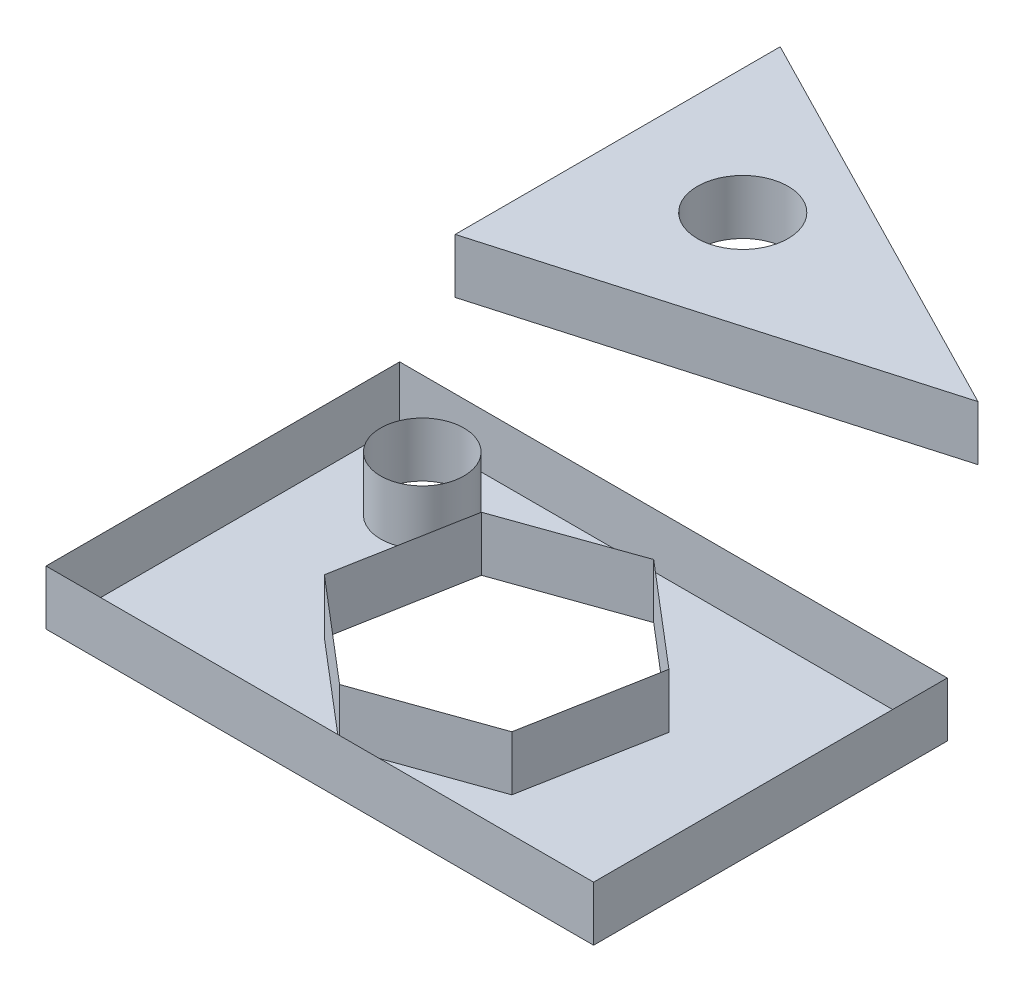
ISO-10303-21;
HEADER;
FILE_DESCRIPTION(('STEP AP214'),'2;1');
FILE_NAME('part.step','',(''),(''),'','','');
FILE_SCHEMA(('AUTOMOTIVE_DESIGN { 1 0 10303 214 1 1 1 1 }'));
ENDSEC;
DATA;
#1=APPLICATION_CONTEXT('core data for automotive mechanical design processes');
#2=APPLICATION_PROTOCOL_DEFINITION('international standard','automotive_design',2000,#1);
#3=PRODUCT_CONTEXT('',#1,'mechanical');
#4=PRODUCT('Part','Part','',(#3));
#5=PRODUCT_RELATED_PRODUCT_CATEGORY('part','',(#4));
#6=PRODUCT_DEFINITION_FORMATION('','',#4);
#7=PRODUCT_DEFINITION_CONTEXT('part definition',#1,'design');
#8=PRODUCT_DEFINITION('design','',#6,#7);
#9=PRODUCT_DEFINITION_SHAPE('','',#8);
#10=(LENGTH_UNIT() NAMED_UNIT(*) SI_UNIT(.MILLI.,.METRE.));
#11=(NAMED_UNIT(*) PLANE_ANGLE_UNIT() SI_UNIT($,.RADIAN.));
#12=(NAMED_UNIT(*) SI_UNIT($,.STERADIAN.) SOLID_ANGLE_UNIT());
#13=UNCERTAINTY_MEASURE_WITH_UNIT(LENGTH_MEASURE(1.E-05),#10,'distance_accuracy_value','');
#14=(GEOMETRIC_REPRESENTATION_CONTEXT(3) GLOBAL_UNCERTAINTY_ASSIGNED_CONTEXT((#13)) GLOBAL_UNIT_ASSIGNED_CONTEXT((#10,
#11,#12)) REPRESENTATION_CONTEXT('',''));
#15=CARTESIAN_POINT('',(0.,0.,0.));
#16=DIRECTION('',(0.,0.,1.));
#17=DIRECTION('',(1.,0.,0.));
#18=AXIS2_PLACEMENT_3D('',#15,#16,#17);
#19=CARTESIAN_POINT('',(38.4002075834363,-25.4,64.2241258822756));
#20=DIRECTION('',(-1.,0.,0.));
#21=DIRECTION('',(0.,0.,1.));
#22=AXIS2_PLACEMENT_3D('',#19,#20,#21);
#23=PLANE('',#22);
#24=DIRECTION('',(0.,0.,1.));
#25=VECTOR('',#24,1.);
#26=CARTESIAN_POINT('',(38.4002075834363,0.,64.2241258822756));
#27=LINE('',#26,#25);
#28=CARTESIAN_POINT('',(38.4002075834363,0.,64.2241258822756));
#29=VERTEX_POINT('',#28);
#30=CARTESIAN_POINT('',(38.4002075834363,0.,228.641244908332));
#31=VERTEX_POINT('',#30);
#32=EDGE_CURVE('E179',#29,#31,#27,.T.);
#33=ORIENTED_EDGE('',*,*,#32,.F.);
#34=DIRECTION('',(0.,1.,0.));
#35=VECTOR('',#34,1.);
#36=CARTESIAN_POINT('',(38.4002075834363,-25.4,64.2241258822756));
#37=LINE('',#36,#35);
#38=CARTESIAN_POINT('',(38.4002075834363,-25.4,64.2241258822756));
#39=VERTEX_POINT('',#38);
#40=EDGE_CURVE('E12',#39,#29,#37,.T.);
#41=ORIENTED_EDGE('',*,*,#40,.F.);
#42=DIRECTION('',(0.,0.,1.));
#43=VECTOR('',#42,1.);
#44=CARTESIAN_POINT('',(38.4002075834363,-25.4,64.2241258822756));
#45=LINE('',#44,#43);
#46=CARTESIAN_POINT('',(38.4002075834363,-25.4,228.641244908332));
#47=VERTEX_POINT('',#46);
#48=EDGE_CURVE('E190',#39,#47,#45,.T.);
#49=ORIENTED_EDGE('',*,*,#48,.T.);
#50=DIRECTION('',(0.,1.,0.));
#51=VECTOR('',#50,1.);
#52=CARTESIAN_POINT('',(38.4002075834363,-25.4,228.641244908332));
#53=LINE('',#52,#51);
#54=EDGE_CURVE('E53',#47,#31,#53,.T.);
#55=ORIENTED_EDGE('',*,*,#54,.T.);
#56=EDGE_LOOP('',(#33,#41,#49,#55));
#57=FACE_BOUND('',#56,.T.);
#58=ADVANCED_FACE('F51',(#57),#23,.T.);
#59=CARTESIAN_POINT('',(38.4002075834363,-25.4,64.2241258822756));
#60=DIRECTION('',(0.,0.,-1.));
#61=DIRECTION('',(-1.,0.,0.));
#62=AXIS2_PLACEMENT_3D('',#59,#60,#61);
#63=PLANE('',#62);
#64=DIRECTION('',(-1.,0.,0.));
#65=VECTOR('',#64,1.);
#66=CARTESIAN_POINT('',(38.4002075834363,0.,64.2241258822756));
#67=LINE('',#66,#65);
#68=CARTESIAN_POINT('',(292.981553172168,0.,64.2241258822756));
#69=VERTEX_POINT('',#68);
#70=EDGE_CURVE('E194',#69,#29,#67,.T.);
#71=ORIENTED_EDGE('',*,*,#70,.F.);
#72=DIRECTION('',(0.,1.,0.));
#73=VECTOR('',#72,1.);
#74=CARTESIAN_POINT('',(292.981553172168,-25.4,64.2241258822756));
#75=LINE('',#74,#73);
#76=CARTESIAN_POINT('',(292.981553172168,-25.4,64.2241258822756));
#77=VERTEX_POINT('',#76);
#78=EDGE_CURVE('E57',#77,#69,#75,.T.);
#79=ORIENTED_EDGE('',*,*,#78,.F.);
#80=DIRECTION('',(-1.,0.,0.));
#81=VECTOR('',#80,1.);
#82=CARTESIAN_POINT('',(38.4002075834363,-25.4,64.2241258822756));
#83=LINE('',#82,#81);
#84=EDGE_CURVE('E200',#77,#39,#83,.T.);
#85=ORIENTED_EDGE('',*,*,#84,.T.);
#86=ORIENTED_EDGE('',*,*,#40,.T.);
#87=EDGE_LOOP('',(#71,#79,#85,#86));
#88=FACE_BOUND('',#87,.T.);
#89=ADVANCED_FACE('F231',(#88),#63,.T.);
#90=CARTESIAN_POINT('',(292.981553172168,-25.4,64.2241258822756));
#91=DIRECTION('',(1.,0.,0.));
#92=DIRECTION('',(0.,0.,-1.));
#93=AXIS2_PLACEMENT_3D('',#90,#91,#92);
#94=PLANE('',#93);
#95=DIRECTION('',(0.,0.,-1.));
#96=VECTOR('',#95,1.);
#97=CARTESIAN_POINT('',(292.981553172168,0.,64.2241258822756));
#98=LINE('',#97,#96);
#99=CARTESIAN_POINT('',(292.981553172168,0.,228.641244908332));
#100=VERTEX_POINT('',#99);
#101=EDGE_CURVE('E210',#100,#69,#98,.T.);
#102=ORIENTED_EDGE('',*,*,#101,.F.);
#103=DIRECTION('',(0.,1.,0.));
#104=VECTOR('',#103,1.);
#105=CARTESIAN_POINT('',(292.981553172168,-25.4,228.641244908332));
#106=LINE('',#105,#104);
#107=CARTESIAN_POINT('',(292.981553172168,-25.4,228.641244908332));
#108=VERTEX_POINT('',#107);
#109=EDGE_CURVE('E217',#108,#100,#106,.T.);
#110=ORIENTED_EDGE('',*,*,#109,.F.);
#111=DIRECTION('',(0.,0.,-1.));
#112=VECTOR('',#111,1.);
#113=CARTESIAN_POINT('',(292.981553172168,-25.4,64.2241258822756));
#114=LINE('',#113,#112);
#115=EDGE_CURVE('E197',#108,#77,#114,.T.);
#116=ORIENTED_EDGE('',*,*,#115,.T.);
#117=ORIENTED_EDGE('',*,*,#78,.T.);
#118=EDGE_LOOP('',(#102,#110,#116,#117));
#119=FACE_BOUND('',#118,.T.);
#120=ADVANCED_FACE('F229',(#119),#94,.T.);
#121=CARTESIAN_POINT('',(38.4002075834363,-25.4,228.641244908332));
#122=DIRECTION('',(0.,0.,1.));
#123=DIRECTION('',(1.,0.,0.));
#124=AXIS2_PLACEMENT_3D('',#121,#122,#123);
#125=PLANE('',#124);
#126=DIRECTION('',(1.,0.,0.));
#127=VECTOR('',#126,1.);
#128=CARTESIAN_POINT('',(38.4002075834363,0.,228.641244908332));
#129=LINE('',#128,#127);
#130=EDGE_CURVE('E206',#31,#100,#129,.T.);
#131=ORIENTED_EDGE('',*,*,#130,.F.);
#132=ORIENTED_EDGE('',*,*,#54,.F.);
#133=DIRECTION('',(1.,0.,0.));
#134=VECTOR('',#133,1.);
#135=CARTESIAN_POINT('',(38.4002075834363,-25.4,228.641244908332));
#136=LINE('',#135,#134);
#137=EDGE_CURVE('E193',#47,#108,#136,.T.);
#138=ORIENTED_EDGE('',*,*,#137,.T.);
#139=ORIENTED_EDGE('',*,*,#109,.T.);
#140=EDGE_LOOP('',(#131,#132,#138,#139));
#141=FACE_BOUND('',#140,.T.);
#142=ADVANCED_FACE('F225',(#141),#125,.T.);
#143=CARTESIAN_POINT('',(0.,-25.4,0.));
#144=DIRECTION('',(0.,1.,0.));
#145=DIRECTION('',(0.,0.,1.));
#146=AXIS2_PLACEMENT_3D('',#143,#144,#145);
#147=PLANE('',#146);
#148=CARTESIAN_POINT('',(79.9464688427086,-25.4,95.2665323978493));
#149=DIRECTION('',(0.,1.,0.));
#150=DIRECTION('',(0.,0.,1.));
#151=AXIS2_PLACEMENT_3D('',#148,#149,#150);
#152=CIRCLE('',#151,19.3434847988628);
#153=CARTESIAN_POINT('',(79.9464688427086,-25.4,114.610017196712));
#154=VERTEX_POINT('',#153);
#155=EDGE_CURVE('E166',#154,#154,#152,.T.);
#156=ORIENTED_EDGE('',*,*,#155,.T.);
#157=EDGE_LOOP('',(#156));
#158=FACE_BOUND('',#157,.T.);
#159=DIRECTION('',(0.761243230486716,0.,0.648466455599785));
#160=VECTOR('',#159,1.);
#161=CARTESIAN_POINT('',(106.609295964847,-25.4,167.440394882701));
#162=LINE('',#161,#160);
#163=CARTESIAN_POINT('',(106.609295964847,-25.4,167.440394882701));
#164=VERTEX_POINT('',#163);
#165=CARTESIAN_POINT('',(154.343298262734,-25.4,208.102693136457));
#166=VERTEX_POINT('',#165);
#167=EDGE_CURVE('E137',#164,#166,#162,.T.);
#168=ORIENTED_EDGE('',*,*,#167,.T.);
#169=DIRECTION('',(0.942210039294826,0.,-0.335022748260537));
#170=VECTOR('',#169,1.);
#171=CARTESIAN_POINT('',(154.343298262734,-25.4,208.102693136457));
#172=LINE('',#171,#170);
#173=CARTESIAN_POINT('',(213.42488267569,-25.4,187.094983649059));
#174=VERTEX_POINT('',#173);
#175=EDGE_CURVE('E131',#166,#174,#172,.T.);
#176=ORIENTED_EDGE('',*,*,#175,.T.);
#177=DIRECTION('',(0.180966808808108,0.,-0.983489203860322));
#178=VECTOR('',#177,1.);
#179=CARTESIAN_POINT('',(213.42488267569,-25.4,187.094983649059));
#180=LINE('',#179,#178);
#181=CARTESIAN_POINT('',(224.772464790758,-25.4,125.424975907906));
#182=VERTEX_POINT('',#181);
#183=EDGE_CURVE('E140',#174,#182,#180,.T.);
#184=ORIENTED_EDGE('',*,*,#183,.T.);
#185=DIRECTION('',(-0.761243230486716,0.,-0.648466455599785));
#186=VECTOR('',#185,1.);
#187=CARTESIAN_POINT('',(224.772464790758,-25.4,125.424975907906));
#188=LINE('',#187,#186);
#189=CARTESIAN_POINT('',(177.03846249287,-25.4,84.7626776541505));
#190=VERTEX_POINT('',#189);
#191=EDGE_CURVE('E65',#182,#190,#188,.T.);
#192=ORIENTED_EDGE('',*,*,#191,.T.);
#193=DIRECTION('',(-0.942210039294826,0.,0.335022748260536));
#194=VECTOR('',#193,1.);
#195=CARTESIAN_POINT('',(177.03846249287,-25.4,84.7626776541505));
#196=LINE('',#195,#194);
#197=CARTESIAN_POINT('',(117.956878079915,-25.4,105.770387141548));
#198=VERTEX_POINT('',#197);
#199=EDGE_CURVE('E158',#190,#198,#196,.T.);
#200=ORIENTED_EDGE('',*,*,#199,.T.);
#201=DIRECTION('',(-0.180966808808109,0.,0.983489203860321));
#202=VECTOR('',#201,1.);
#203=CARTESIAN_POINT('',(117.956878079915,-25.4,105.770387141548));
#204=LINE('',#203,#202);
#205=EDGE_CURVE('E161',#198,#164,#204,.T.);
#206=ORIENTED_EDGE('',*,*,#205,.T.);
#207=EDGE_LOOP('',(#168,#176,#184,#192,#200,#206));
#208=FACE_BOUND('',#207,.T.);
#209=ORIENTED_EDGE('',*,*,#48,.F.);
#210=ORIENTED_EDGE('',*,*,#84,.F.);
#211=ORIENTED_EDGE('',*,*,#115,.F.);
#212=ORIENTED_EDGE('',*,*,#137,.F.);
#213=EDGE_LOOP('',(#209,#210,#211,#212));
#214=FACE_BOUND('',#213,.T.);
#215=ADVANCED_FACE('F144',(#158,#208,#214),#147,.F.);
#216=CARTESIAN_POINT('',(154.343298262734,-25.4,208.102693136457));
#217=DIRECTION('',(0.335022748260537,0.,0.942210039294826));
#218=DIRECTION('',(0.942210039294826,0.,-0.335022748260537));
#219=AXIS2_PLACEMENT_3D('',#216,#217,#218);
#220=PLANE('',#219);
#221=DIRECTION('',(0.942210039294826,0.,-0.335022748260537));
#222=VECTOR('',#221,1.);
#223=CARTESIAN_POINT('',(154.343298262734,0.,208.102693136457));
#224=LINE('',#223,#222);
#225=CARTESIAN_POINT('',(154.343298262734,0.,208.102693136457));
#226=VERTEX_POINT('',#225);
#227=CARTESIAN_POINT('',(213.42488267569,0.,187.094983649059));
#228=VERTEX_POINT('',#227);
#229=EDGE_CURVE('E134',#226,#228,#224,.T.);
#230=ORIENTED_EDGE('',*,*,#229,.T.);
#231=DIRECTION('',(0.,1.,0.));
#232=VECTOR('',#231,1.);
#233=CARTESIAN_POINT('',(213.42488267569,-25.4,187.094983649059));
#234=LINE('',#233,#232);
#235=EDGE_CURVE('E126',#174,#228,#234,.T.);
#236=ORIENTED_EDGE('',*,*,#235,.F.);
#237=ORIENTED_EDGE('',*,*,#175,.F.);
#238=DIRECTION('',(0.,1.,0.));
#239=VECTOR('',#238,1.);
#240=CARTESIAN_POINT('',(154.343298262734,-25.4,208.102693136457));
#241=LINE('',#240,#239);
#242=EDGE_CURVE('E177',#166,#226,#241,.T.);
#243=ORIENTED_EDGE('',*,*,#242,.T.);
#244=EDGE_LOOP('',(#230,#236,#237,#243));
#245=FACE_BOUND('',#244,.T.);
#246=ADVANCED_FACE('F128',(#245),#220,.F.);
#247=CARTESIAN_POINT('',(106.609295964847,-25.4,167.440394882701));
#248=DIRECTION('',(-0.648466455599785,0.,0.761243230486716));
#249=DIRECTION('',(0.761243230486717,0.,0.648466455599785));
#250=AXIS2_PLACEMENT_3D('',#247,#248,#249);
#251=PLANE('',#250);
#252=DIRECTION('',(0.761243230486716,0.,0.648466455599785));
#253=VECTOR('',#252,1.);
#254=CARTESIAN_POINT('',(106.609295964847,0.,167.440394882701));
#255=LINE('',#254,#253);
#256=CARTESIAN_POINT('',(106.609295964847,0.,167.440394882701));
#257=VERTEX_POINT('',#256);
#258=EDGE_CURVE('E148',#257,#226,#255,.T.);
#259=ORIENTED_EDGE('',*,*,#258,.T.);
#260=ORIENTED_EDGE('',*,*,#242,.F.);
#261=ORIENTED_EDGE('',*,*,#167,.F.);
#262=DIRECTION('',(0.,1.,0.));
#263=VECTOR('',#262,1.);
#264=CARTESIAN_POINT('',(106.609295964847,-25.4,167.440394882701));
#265=LINE('',#264,#263);
#266=EDGE_CURVE('E180',#164,#257,#265,.T.);
#267=ORIENTED_EDGE('',*,*,#266,.T.);
#268=EDGE_LOOP('',(#259,#260,#261,#267));
#269=FACE_BOUND('',#268,.T.);
#270=ADVANCED_FACE('F249',(#269),#251,.F.);
#271=CARTESIAN_POINT('',(117.956878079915,-25.4,105.770387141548));
#272=DIRECTION('',(-0.983489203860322,0.,-0.180966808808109));
#273=DIRECTION('',(-0.180966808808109,0.,0.983489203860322));
#274=AXIS2_PLACEMENT_3D('',#271,#272,#273);
#275=PLANE('',#274);
#276=DIRECTION('',(-0.180966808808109,0.,0.983489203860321));
#277=VECTOR('',#276,1.);
#278=CARTESIAN_POINT('',(117.956878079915,0.,105.770387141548));
#279=LINE('',#278,#277);
#280=CARTESIAN_POINT('',(117.956878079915,0.,105.770387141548));
#281=VERTEX_POINT('',#280);
#282=EDGE_CURVE('E151',#281,#257,#279,.T.);
#283=ORIENTED_EDGE('',*,*,#282,.T.);
#284=ORIENTED_EDGE('',*,*,#266,.F.);
#285=ORIENTED_EDGE('',*,*,#205,.F.);
#286=DIRECTION('',(0.,1.,0.));
#287=VECTOR('',#286,1.);
#288=CARTESIAN_POINT('',(117.956878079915,-25.4,105.770387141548));
#289=LINE('',#288,#287);
#290=EDGE_CURVE('E183',#198,#281,#289,.T.);
#291=ORIENTED_EDGE('',*,*,#290,.T.);
#292=EDGE_LOOP('',(#283,#284,#285,#291));
#293=FACE_BOUND('',#292,.T.);
#294=ADVANCED_FACE('F270',(#293),#275,.F.);
#295=CARTESIAN_POINT('',(177.03846249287,-25.4,84.7626776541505));
#296=DIRECTION('',(-0.335022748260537,0.,-0.942210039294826));
#297=DIRECTION('',(-0.942210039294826,0.,0.335022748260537));
#298=AXIS2_PLACEMENT_3D('',#295,#296,#297);
#299=PLANE('',#298);
#300=DIRECTION('',(-0.942210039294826,0.,0.335022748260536));
#301=VECTOR('',#300,1.);
#302=CARTESIAN_POINT('',(177.03846249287,0.,84.7626776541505));
#303=LINE('',#302,#301);
#304=CARTESIAN_POINT('',(177.03846249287,0.,84.7626776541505));
#305=VERTEX_POINT('',#304);
#306=EDGE_CURVE('E172',#305,#281,#303,.T.);
#307=ORIENTED_EDGE('',*,*,#306,.T.);
#308=ORIENTED_EDGE('',*,*,#290,.F.);
#309=ORIENTED_EDGE('',*,*,#199,.F.);
#310=DIRECTION('',(0.,1.,0.));
#311=VECTOR('',#310,1.);
#312=CARTESIAN_POINT('',(177.03846249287,-25.4,84.7626776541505));
#313=LINE('',#312,#311);
#314=EDGE_CURVE('E186',#190,#305,#313,.T.);
#315=ORIENTED_EDGE('',*,*,#314,.T.);
#316=EDGE_LOOP('',(#307,#308,#309,#315));
#317=FACE_BOUND('',#316,.T.);
#318=ADVANCED_FACE('F274',(#317),#299,.F.);
#319=CARTESIAN_POINT('',(224.772464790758,-25.4,125.424975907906));
#320=DIRECTION('',(0.648466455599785,0.,-0.761243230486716));
#321=DIRECTION('',(-0.761243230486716,0.,-0.648466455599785));
#322=AXIS2_PLACEMENT_3D('',#319,#320,#321);
#323=PLANE('',#322);
#324=DIRECTION('',(-0.761243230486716,0.,-0.648466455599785));
#325=VECTOR('',#324,1.);
#326=CARTESIAN_POINT('',(224.772464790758,0.,125.424975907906));
#327=LINE('',#326,#325);
#328=CARTESIAN_POINT('',(224.772464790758,0.,125.424975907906));
#329=VERTEX_POINT('',#328);
#330=EDGE_CURVE('E169',#329,#305,#327,.T.);
#331=ORIENTED_EDGE('',*,*,#330,.T.);
#332=ORIENTED_EDGE('',*,*,#314,.F.);
#333=ORIENTED_EDGE('',*,*,#191,.F.);
#334=DIRECTION('',(0.,1.,0.));
#335=VECTOR('',#334,1.);
#336=CARTESIAN_POINT('',(224.772464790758,-25.4,125.424975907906));
#337=LINE('',#336,#335);
#338=EDGE_CURVE('E136',#182,#329,#337,.T.);
#339=ORIENTED_EDGE('',*,*,#338,.T.);
#340=EDGE_LOOP('',(#331,#332,#333,#339));
#341=FACE_BOUND('',#340,.T.);
#342=ADVANCED_FACE('F265',(#341),#323,.F.);
#343=CARTESIAN_POINT('',(213.42488267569,-25.4,187.094983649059));
#344=DIRECTION('',(0.983489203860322,0.,0.180966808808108));
#345=DIRECTION('',(0.180966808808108,0.,-0.983489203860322));
#346=AXIS2_PLACEMENT_3D('',#343,#344,#345);
#347=PLANE('',#346);
#348=DIRECTION('',(0.180966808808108,0.,-0.983489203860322));
#349=VECTOR('',#348,1.);
#350=CARTESIAN_POINT('',(213.42488267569,0.,187.094983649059));
#351=LINE('',#350,#349);
#352=EDGE_CURVE('E70',#228,#329,#351,.T.);
#353=ORIENTED_EDGE('',*,*,#352,.T.);
#354=ORIENTED_EDGE('',*,*,#338,.F.);
#355=ORIENTED_EDGE('',*,*,#183,.F.);
#356=ORIENTED_EDGE('',*,*,#235,.T.);
#357=EDGE_LOOP('',(#353,#354,#355,#356));
#358=FACE_BOUND('',#357,.T.);
#359=ADVANCED_FACE('F141',(#358),#347,.F.);
#360=CARTESIAN_POINT('',(79.9464688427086,-25.4,95.2665323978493));
#361=DIRECTION('',(0.,1.,0.));
#362=DIRECTION('',(0.,0.,1.));
#363=AXIS2_PLACEMENT_3D('',#360,#361,#362);
#364=CYLINDRICAL_SURFACE('',#363,19.3434847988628);
#365=ORIENTED_EDGE('',*,*,#155,.F.);
#366=EDGE_LOOP('',(#365));
#367=FACE_BOUND('',#366,.T.);
#368=CARTESIAN_POINT('',(79.9464688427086,0.,95.2665323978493));
#369=DIRECTION('',(0.,1.,0.));
#370=DIRECTION('',(0.,0.,1.));
#371=AXIS2_PLACEMENT_3D('',#368,#369,#370);
#372=CIRCLE('',#371,19.3434847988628);
#373=CARTESIAN_POINT('',(79.9464688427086,0.,114.610017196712));
#374=VERTEX_POINT('',#373);
#375=EDGE_CURVE('E154',#374,#374,#372,.T.);
#376=ORIENTED_EDGE('',*,*,#375,.T.);
#377=EDGE_LOOP('',(#376));
#378=FACE_BOUND('',#377,.T.);
#379=ADVANCED_FACE('F259',(#367,#378),#364,.F.);
#380=OPEN_SHELL('',(#58,#89,#120,#142,#215,#246,#270,#294,#318,#342,#359,#379));
#381=SHELL_BASED_SURFACE_MODEL('B2',(#380));
#382=CARTESIAN_POINT('',(188.850758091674,-25.4,-54.2005244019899));
#383=DIRECTION('',(0.275865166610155,0.,0.961196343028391));
#384=DIRECTION('',(0.961196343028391,0.,-0.275865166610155));
#385=AXIS2_PLACEMENT_3D('',#382,#383,#384);
#386=PLANE('',#385);
#387=DIRECTION('',(0.961196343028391,0.,-0.275865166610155));
#388=VECTOR('',#387,1.);
#389=CARTESIAN_POINT('',(188.850758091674,0.,-54.2005244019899));
#390=LINE('',#389,#388);
#391=CARTESIAN_POINT('',(0.,0.,0.));
#392=VERTEX_POINT('',#391);
#393=CARTESIAN_POINT('',(188.850758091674,0.,-54.2005244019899));
#394=VERTEX_POINT('',#393);
#395=EDGE_CURVE('E440',#392,#394,#390,.T.);
#396=ORIENTED_EDGE('',*,*,#395,.F.);
#397=DIRECTION('',(0.,1.,0.));
#398=VECTOR('',#397,1.);
#399=CARTESIAN_POINT('',(0.,-25.4,0.));
#400=LINE('',#399,#398);
#401=CARTESIAN_POINT('',(0.,-25.4,0.));
#402=VERTEX_POINT('',#401);
#403=EDGE_CURVE('E49',#402,#392,#400,.T.);
#404=ORIENTED_EDGE('',*,*,#403,.F.);
#405=DIRECTION('',(0.961196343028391,0.,-0.275865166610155));
#406=VECTOR('',#405,1.);
#407=CARTESIAN_POINT('',(188.850758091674,-25.4,-54.2005244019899));
#408=LINE('',#407,#406);
#409=CARTESIAN_POINT('',(188.850758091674,-25.4,-54.2005244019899));
#410=VERTEX_POINT('',#409);
#411=EDGE_CURVE('E429',#402,#410,#408,.T.);
#412=ORIENTED_EDGE('',*,*,#411,.T.);
#413=DIRECTION('',(0.,1.,0.));
#414=VECTOR('',#413,1.);
#415=CARTESIAN_POINT('',(188.850758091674,-25.4,-54.2005244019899));
#416=LINE('',#415,#414);
#417=EDGE_CURVE('E388',#410,#394,#416,.T.);
#418=ORIENTED_EDGE('',*,*,#417,.T.);
#419=EDGE_LOOP('',(#396,#404,#412,#418));
#420=FACE_BOUND('',#419,.T.);
#421=ADVANCED_FACE('F385',(#420),#386,.T.);
#422=CARTESIAN_POINT('',(0.,-25.4,0.));
#423=DIRECTION('',(-1.,0.,0.));
#424=DIRECTION('',(0.,0.,1.));
#425=AXIS2_PLACEMENT_3D('',#422,#423,#424);
#426=PLANE('',#425);
#427=DIRECTION('',(0.,0.,1.));
#428=VECTOR('',#427,1.);
#429=CARTESIAN_POINT('',(0.,0.,0.));
#430=LINE('',#429,#428);
#431=CARTESIAN_POINT('',(0.,0.,-151.08879673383));
#432=VERTEX_POINT('',#431);
#433=EDGE_CURVE('E431',#432,#392,#430,.T.);
#434=ORIENTED_EDGE('',*,*,#433,.F.);
#435=DIRECTION('',(0.,1.,0.));
#436=VECTOR('',#435,1.);
#437=CARTESIAN_POINT('',(0.,-25.4,-151.08879673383));
#438=LINE('',#437,#436);
#439=CARTESIAN_POINT('',(0.,-25.4,-151.08879673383));
#440=VERTEX_POINT('',#439);
#441=EDGE_CURVE('E394',#440,#432,#438,.T.);
#442=ORIENTED_EDGE('',*,*,#441,.F.);
#443=DIRECTION('',(0.,0.,1.));
#444=VECTOR('',#443,1.);
#445=CARTESIAN_POINT('',(0.,-25.4,0.));
#446=LINE('',#445,#444);
#447=EDGE_CURVE('E426',#440,#402,#446,.T.);
#448=ORIENTED_EDGE('',*,*,#447,.T.);
#449=ORIENTED_EDGE('',*,*,#403,.T.);
#450=EDGE_LOOP('',(#434,#442,#448,#449));
#451=FACE_BOUND('',#450,.T.);
#452=ADVANCED_FACE('F445',(#451),#426,.T.);
#453=CARTESIAN_POINT('',(0.,-25.4,-151.08879673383));
#454=DIRECTION('',(0.456472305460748,0.,-0.889737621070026));
#455=DIRECTION('',(-0.889737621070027,0.,-0.456472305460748));
#456=AXIS2_PLACEMENT_3D('',#453,#454,#455);
#457=PLANE('',#456);
#458=DIRECTION('',(-0.889737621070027,0.,-0.456472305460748));
#459=VECTOR('',#458,1.);
#460=CARTESIAN_POINT('',(0.,0.,-151.08879673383));
#461=LINE('',#460,#459);
#462=EDGE_CURVE('E424',#394,#432,#461,.T.);
#463=ORIENTED_EDGE('',*,*,#462,.F.);
#464=ORIENTED_EDGE('',*,*,#417,.F.);
#465=DIRECTION('',(-0.889737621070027,0.,-0.456472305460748));
#466=VECTOR('',#465,1.);
#467=CARTESIAN_POINT('',(0.,-25.4,-151.08879673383));
#468=LINE('',#467,#466);
#469=EDGE_CURVE('E422',#410,#440,#468,.T.);
#470=ORIENTED_EDGE('',*,*,#469,.T.);
#471=ORIENTED_EDGE('',*,*,#441,.T.);
#472=EDGE_LOOP('',(#463,#464,#470,#471));
#473=FACE_BOUND('',#472,.T.);
#474=ADVANCED_FACE('F421',(#473),#457,.T.);
#475=CARTESIAN_POINT('',(0.,-25.4,0.));
#476=DIRECTION('',(0.,-1.,0.));
#477=DIRECTION('',(0.,0.,-1.));
#478=AXIS2_PLACEMENT_3D('',#475,#476,#477);
#479=PLANE('',#478);
#480=CARTESIAN_POINT('',(58.0016480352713,-25.4,-75.6757600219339));
#481=DIRECTION('',(0.,1.,0.));
#482=DIRECTION('',(0.,0.,1.));
#483=AXIS2_PLACEMENT_3D('',#480,#481,#482);
#484=CIRCLE('',#483,21.0766431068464);
#485=CARTESIAN_POINT('',(58.0016480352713,-25.4,-54.5991169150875));
#486=VERTEX_POINT('',#485);
#487=EDGE_CURVE('E442',#486,#486,#484,.T.);
#488=ORIENTED_EDGE('',*,*,#487,.T.);
#489=EDGE_LOOP('',(#488));
#490=FACE_BOUND('',#489,.T.);
#491=ORIENTED_EDGE('',*,*,#411,.F.);
#492=ORIENTED_EDGE('',*,*,#447,.F.);
#493=ORIENTED_EDGE('',*,*,#469,.F.);
#494=EDGE_LOOP('',(#491,#492,#493));
#495=FACE_BOUND('',#494,.T.);
#496=ADVANCED_FACE('F428',(#490,#495),#479,.T.);
#497=CARTESIAN_POINT('',(0.,0.,0.));
#498=DIRECTION('',(0.,-1.,0.));
#499=DIRECTION('',(0.,0.,-1.));
#500=AXIS2_PLACEMENT_3D('',#497,#498,#499);
#501=PLANE('',#500);
#502=CARTESIAN_POINT('',(58.0016480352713,0.,-75.6757600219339));
#503=DIRECTION('',(0.,1.,0.));
#504=DIRECTION('',(0.,0.,1.));
#505=AXIS2_PLACEMENT_3D('',#502,#503,#504);
#506=CIRCLE('',#505,21.0766431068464);
#507=CARTESIAN_POINT('',(58.0016480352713,0.,-54.5991169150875));
#508=VERTEX_POINT('',#507);
#509=EDGE_CURVE('E436',#508,#508,#506,.T.);
#510=ORIENTED_EDGE('',*,*,#509,.F.);
#511=EDGE_LOOP('',(#510));
#512=FACE_BOUND('',#511,.T.);
#513=ORIENTED_EDGE('',*,*,#395,.T.);
#514=ORIENTED_EDGE('',*,*,#462,.T.);
#515=ORIENTED_EDGE('',*,*,#433,.T.);
#516=EDGE_LOOP('',(#513,#514,#515));
#517=FACE_BOUND('',#516,.T.);
#518=ADVANCED_FACE('F444',(#512,#517),#501,.F.);
#519=CARTESIAN_POINT('',(58.0016480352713,-25.4,-75.6757600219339));
#520=DIRECTION('',(0.,1.,0.));
#521=DIRECTION('',(0.,0.,1.));
#522=AXIS2_PLACEMENT_3D('',#519,#520,#521);
#523=CYLINDRICAL_SURFACE('',#522,21.0766431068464);
#524=ORIENTED_EDGE('',*,*,#487,.F.);
#525=EDGE_LOOP('',(#524));
#526=FACE_BOUND('',#525,.T.);
#527=ORIENTED_EDGE('',*,*,#509,.T.);
#528=EDGE_LOOP('',(#527));
#529=FACE_BOUND('',#528,.T.);
#530=ADVANCED_FACE('F455',(#526,#529),#523,.F.);
#531=CLOSED_SHELL('',(#421,#452,#474,#496,#518,#530));
#532=MANIFOLD_SOLID_BREP('B6',#531);
#533=ADVANCED_BREP_SHAPE_REPRESENTATION('',(#18,#532),#14);
#534=MANIFOLD_SURFACE_SHAPE_REPRESENTATION('',(#18,#381),#14);
#535=SHAPE_REPRESENTATION('',(#18),#14);
#536=SHAPE_DEFINITION_REPRESENTATION(#9,#535);
#537=SHAPE_REPRESENTATION_RELATIONSHIP('','',#535,#533);
#538=SHAPE_REPRESENTATION_RELATIONSHIP('','',#535,#534);
ENDSEC;
END-ISO-10303-21;
